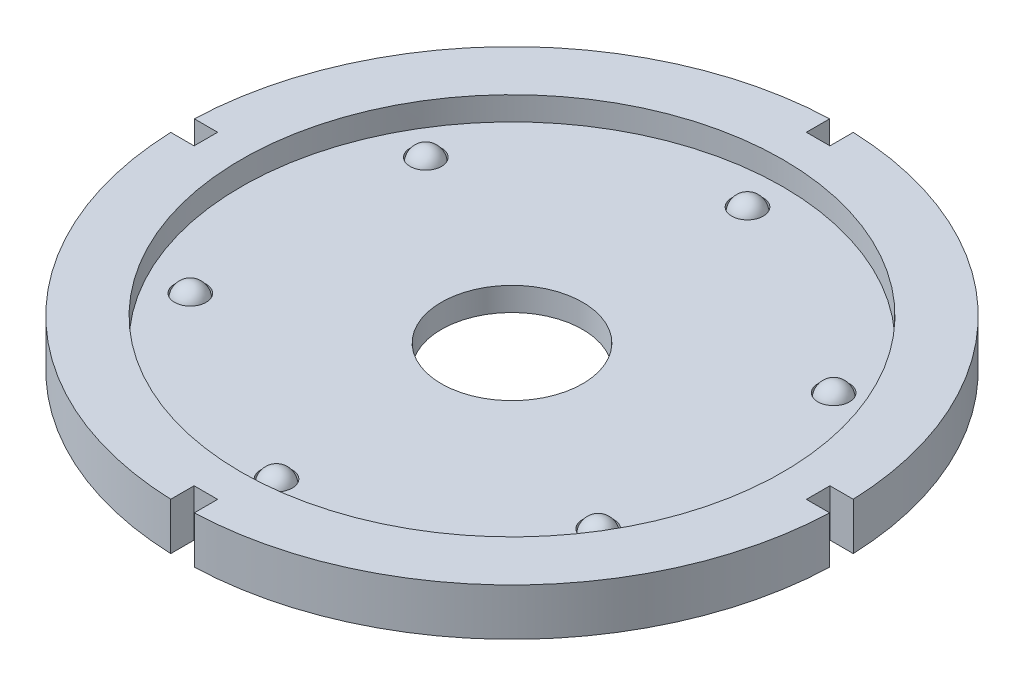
ISO-10303-21;
HEADER;
FILE_DESCRIPTION(('STEP AP214'),'2;1');
FILE_NAME('part.step','',(''),(''),'','','');
FILE_SCHEMA(('AUTOMOTIVE_DESIGN { 1 0 10303 214 1 1 1 1 }'));
ENDSEC;
DATA;
#1=APPLICATION_CONTEXT('core data for automotive mechanical design processes');
#2=APPLICATION_PROTOCOL_DEFINITION('international standard','automotive_design',2000,#1);
#3=PRODUCT_CONTEXT('',#1,'mechanical');
#4=PRODUCT('Part','Part','',(#3));
#5=PRODUCT_RELATED_PRODUCT_CATEGORY('part','',(#4));
#6=PRODUCT_DEFINITION_FORMATION('','',#4);
#7=PRODUCT_DEFINITION_CONTEXT('part definition',#1,'design');
#8=PRODUCT_DEFINITION('design','',#6,#7);
#9=PRODUCT_DEFINITION_SHAPE('','',#8);
#10=(LENGTH_UNIT() NAMED_UNIT(*) SI_UNIT(.MILLI.,.METRE.));
#11=(NAMED_UNIT(*) PLANE_ANGLE_UNIT() SI_UNIT($,.RADIAN.));
#12=(NAMED_UNIT(*) SI_UNIT($,.STERADIAN.) SOLID_ANGLE_UNIT());
#13=UNCERTAINTY_MEASURE_WITH_UNIT(LENGTH_MEASURE(1.E-05),#10,'distance_accuracy_value','');
#14=(GEOMETRIC_REPRESENTATION_CONTEXT(3) GLOBAL_UNCERTAINTY_ASSIGNED_CONTEXT((#13)) GLOBAL_UNIT_ASSIGNED_CONTEXT((#10,
#11,#12)) REPRESENTATION_CONTEXT('',''));
#15=CARTESIAN_POINT('',(0.,0.,0.));
#16=DIRECTION('',(0.,0.,1.));
#17=DIRECTION('',(1.,0.,0.));
#18=AXIS2_PLACEMENT_3D('',#15,#16,#17);
#19=CARTESIAN_POINT('',(43.308152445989,3.86417949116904,25.0039734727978));
#20=DIRECTION('',(0.,1.,0.));
#21=DIRECTION('',(-0.866025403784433,0.,-0.50000000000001));
#22=AXIS2_PLACEMENT_3D('',#19,#20,#21);
#23=SPHERICAL_SURFACE('',#22,3.25);
#24=CARTESIAN_POINT('',(43.308152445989,7.11417949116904,25.0039734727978));
#25=VERTEX_POINT('',#24);
#26=VERTEX_LOOP('',#25);
#27=FACE_BOUND('',#26,.T.);
#28=ADVANCED_FACE('F39',(#27),#23,.T.);
#29=CLOSED_SHELL('',(#28));
#30=MANIFOLD_SOLID_BREP('B2',#29);
#31=CARTESIAN_POINT('',(43.3081524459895,3.86417949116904,-25.0039734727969));
#32=DIRECTION('',(0.,1.,0.));
#33=DIRECTION('',(-0.866025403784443,0.,0.499999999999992));
#34=AXIS2_PLACEMENT_3D('',#31,#32,#33);
#35=SPHERICAL_SURFACE('',#34,3.25);
#36=CARTESIAN_POINT('',(43.3081524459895,7.11417949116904,-25.0039734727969));
#37=VERTEX_POINT('',#36);
#38=VERTEX_LOOP('',#37);
#39=FACE_BOUND('',#38,.T.);
#40=ADVANCED_FACE('F59',(#39),#35,.T.);
#41=CLOSED_SHELL('',(#40));
#42=MANIFOLD_SOLID_BREP('B6',#41);
#43=CARTESIAN_POINT('',(0.,3.86417949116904,-50.0079469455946));
#44=DIRECTION('',(0.,1.,0.));
#45=DIRECTION('',(0.,0.,1.));
#46=AXIS2_PLACEMENT_3D('',#43,#44,#45);
#47=SPHERICAL_SURFACE('',#46,3.25);
#48=CARTESIAN_POINT('',(0.,7.11417949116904,-50.0079469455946));
#49=VERTEX_POINT('',#48);
#50=VERTEX_LOOP('',#49);
#51=FACE_BOUND('',#50,.T.);
#52=ADVANCED_FACE('F79',(#51),#47,.T.);
#53=CLOSED_SHELL('',(#52));
#54=MANIFOLD_SOLID_BREP('B35',#53);
#55=CARTESIAN_POINT('',(-43.3081524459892,3.86417949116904,-25.0039734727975));
#56=DIRECTION('',(0.,1.,0.));
#57=DIRECTION('',(0.866025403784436,0.,0.500000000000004));
#58=AXIS2_PLACEMENT_3D('',#55,#56,#57);
#59=SPHERICAL_SURFACE('',#58,3.25);
#60=CARTESIAN_POINT('',(-43.3081524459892,7.11417949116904,-25.0039734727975));
#61=VERTEX_POINT('',#60);
#62=VERTEX_LOOP('',#61);
#63=FACE_BOUND('',#62,.T.);
#64=ADVANCED_FACE('F99',(#63),#59,.T.);
#65=CLOSED_SHELL('',(#64));
#66=MANIFOLD_SOLID_BREP('B55',#65);
#67=CARTESIAN_POINT('',(-43.3081524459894,3.86417949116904,25.0039734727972));
#68=DIRECTION('',(0.,1.,0.));
#69=DIRECTION('',(0.86602540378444,0.,-0.499999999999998));
#70=AXIS2_PLACEMENT_3D('',#67,#68,#69);
#71=SPHERICAL_SURFACE('',#70,3.25);
#72=CARTESIAN_POINT('',(-43.3081524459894,7.11417949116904,25.0039734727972));
#73=VERTEX_POINT('',#72);
#74=VERTEX_LOOP('',#73);
#75=FACE_BOUND('',#74,.T.);
#76=ADVANCED_FACE('F119',(#75),#71,.T.);
#77=CLOSED_SHELL('',(#76));
#78=MANIFOLD_SOLID_BREP('B75',#77);
#79=CARTESIAN_POINT('',(0.,3.86417949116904,50.0079469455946));
#80=DIRECTION('',(0.,1.,0.));
#81=DIRECTION('',(0.,0.,-1.));
#82=AXIS2_PLACEMENT_3D('',#79,#80,#81);
#83=SPHERICAL_SURFACE('',#82,3.25);
#84=CARTESIAN_POINT('',(0.,7.11417949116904,50.0079469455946));
#85=VERTEX_POINT('',#84);
#86=VERTEX_LOOP('',#85);
#87=FACE_BOUND('',#86,.T.);
#88=ADVANCED_FACE('F142',(#87),#83,.T.);
#89=CLOSED_SHELL('',(#88));
#90=MANIFOLD_SOLID_BREP('B95',#89);
#91=CARTESIAN_POINT('',(0.,10.,0.));
#92=DIRECTION('',(0.,1.,0.));
#93=DIRECTION('',(0.,0.,1.));
#94=AXIS2_PLACEMENT_3D('',#91,#92,#93);
#95=PLANE('',#94);
#96=DIRECTION('',(1.,0.,0.));
#97=VECTOR('',#96,1.);
#98=CARTESIAN_POINT('',(0.,10.,2.5));
#99=LINE('',#98,#97);
#100=CARTESIAN_POINT('',(65.,10.,2.5));
#101=VERTEX_POINT('',#100);
#102=CARTESIAN_POINT('',(69.9553428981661,10.,2.5));
#103=VERTEX_POINT('',#102);
#104=EDGE_CURVE('E348',#101,#103,#99,.T.);
#105=ORIENTED_EDGE('',*,*,#104,.F.);
#106=DIRECTION('',(0.,0.,1.));
#107=VECTOR('',#106,1.);
#108=CARTESIAN_POINT('',(65.,10.,0.));
#109=LINE('',#108,#107);
#110=CARTESIAN_POINT('',(65.,10.,-2.5));
#111=VERTEX_POINT('',#110);
#112=EDGE_CURVE('E358',#111,#101,#109,.T.);
#113=ORIENTED_EDGE('',*,*,#112,.F.);
#114=DIRECTION('',(1.,0.,0.));
#115=VECTOR('',#114,1.);
#116=CARTESIAN_POINT('',(0.,10.,-2.5));
#117=LINE('',#116,#115);
#118=CARTESIAN_POINT('',(69.9553428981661,10.,-2.5));
#119=VERTEX_POINT('',#118);
#120=EDGE_CURVE('E272',#111,#119,#117,.T.);
#121=ORIENTED_EDGE('',*,*,#120,.T.);
#122=CARTESIAN_POINT('',(0.,10.,0.));
#123=DIRECTION('',(0.,1.,0.));
#124=DIRECTION('',(0.,0.,1.));
#125=AXIS2_PLACEMENT_3D('',#122,#123,#124);
#126=CIRCLE('',#125,70.);
#127=CARTESIAN_POINT('',(2.5,10.,-69.9553428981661));
#128=VERTEX_POINT('',#127);
#129=EDGE_CURVE('E379',#119,#128,#126,.T.);
#130=ORIENTED_EDGE('',*,*,#129,.T.);
#131=DIRECTION('',(0.,0.,-1.));
#132=VECTOR('',#131,1.);
#133=CARTESIAN_POINT('',(2.50000000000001,10.,0.));
#134=LINE('',#133,#132);
#135=CARTESIAN_POINT('',(2.5,10.,-65.));
#136=VERTEX_POINT('',#135);
#137=EDGE_CURVE('E298',#136,#128,#134,.T.);
#138=ORIENTED_EDGE('',*,*,#137,.F.);
#139=DIRECTION('',(1.,0.,0.));
#140=VECTOR('',#139,1.);
#141=CARTESIAN_POINT('',(0.,10.,-65.));
#142=LINE('',#141,#140);
#143=CARTESIAN_POINT('',(-2.5,10.,-65.));
#144=VERTEX_POINT('',#143);
#145=EDGE_CURVE('E350',#144,#136,#142,.T.);
#146=ORIENTED_EDGE('',*,*,#145,.F.);
#147=DIRECTION('',(0.,0.,-1.));
#148=VECTOR('',#147,1.);
#149=CARTESIAN_POINT('',(-2.5,10.,0.));
#150=LINE('',#149,#148);
#151=CARTESIAN_POINT('',(-2.5,10.,-69.9553428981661));
#152=VERTEX_POINT('',#151);
#153=EDGE_CURVE('E335',#144,#152,#150,.T.);
#154=ORIENTED_EDGE('',*,*,#153,.T.);
#155=CARTESIAN_POINT('',(-69.9553428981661,10.,-2.5));
#156=VERTEX_POINT('',#155);
#157=EDGE_CURVE('E419',#152,#156,#126,.T.);
#158=ORIENTED_EDGE('',*,*,#157,.T.);
#159=DIRECTION('',(-1.,0.,0.));
#160=VECTOR('',#159,1.);
#161=CARTESIAN_POINT('',(0.,10.,-2.5));
#162=LINE('',#161,#160);
#163=CARTESIAN_POINT('',(-65.,10.,-2.5));
#164=VERTEX_POINT('',#163);
#165=EDGE_CURVE('E338',#164,#156,#162,.T.);
#166=ORIENTED_EDGE('',*,*,#165,.F.);
#167=DIRECTION('',(0.,0.,1.));
#168=VECTOR('',#167,1.);
#169=CARTESIAN_POINT('',(-65.,10.,0.));
#170=LINE('',#169,#168);
#171=CARTESIAN_POINT('',(-65.,10.,2.5));
#172=VERTEX_POINT('',#171);
#173=EDGE_CURVE('E352',#164,#172,#170,.T.);
#174=ORIENTED_EDGE('',*,*,#173,.T.);
#175=DIRECTION('',(-1.,0.,0.));
#176=VECTOR('',#175,1.);
#177=CARTESIAN_POINT('',(0.,10.,2.5));
#178=LINE('',#177,#176);
#179=CARTESIAN_POINT('',(-69.9553428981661,10.,2.5));
#180=VERTEX_POINT('',#179);
#181=EDGE_CURVE('E340',#172,#180,#178,.T.);
#182=ORIENTED_EDGE('',*,*,#181,.T.);
#183=CARTESIAN_POINT('',(-2.5,10.,69.9553428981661));
#184=VERTEX_POINT('',#183);
#185=EDGE_CURVE('E380',#180,#184,#126,.T.);
#186=ORIENTED_EDGE('',*,*,#185,.T.);
#187=DIRECTION('',(0.,0.,1.));
#188=VECTOR('',#187,1.);
#189=CARTESIAN_POINT('',(-2.5,10.,0.));
#190=LINE('',#189,#188);
#191=CARTESIAN_POINT('',(-2.5,10.,65.));
#192=VERTEX_POINT('',#191);
#193=EDGE_CURVE('E179',#192,#184,#190,.T.);
#194=ORIENTED_EDGE('',*,*,#193,.F.);
#195=DIRECTION('',(1.,0.,0.));
#196=VECTOR('',#195,1.);
#197=CARTESIAN_POINT('',(0.,10.,65.));
#198=LINE('',#197,#196);
#199=CARTESIAN_POINT('',(2.5,10.,65.));
#200=VERTEX_POINT('',#199);
#201=EDGE_CURVE('E355',#192,#200,#198,.T.);
#202=ORIENTED_EDGE('',*,*,#201,.T.);
#203=DIRECTION('',(0.,0.,1.));
#204=VECTOR('',#203,1.);
#205=CARTESIAN_POINT('',(2.50000000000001,10.,0.));
#206=LINE('',#205,#204);
#207=CARTESIAN_POINT('',(2.5,10.,69.9553428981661));
#208=VERTEX_POINT('',#207);
#209=EDGE_CURVE('E344',#200,#208,#206,.T.);
#210=ORIENTED_EDGE('',*,*,#209,.T.);
#211=EDGE_CURVE('E375',#208,#103,#126,.T.);
#212=ORIENTED_EDGE('',*,*,#211,.T.);
#213=EDGE_LOOP('',(#105,#113,#121,#130,#138,#146,#154,#158,#166,#174,#182,#186,#194,#202,#210,#212));
#214=FACE_BOUND('',#213,.T.);
#215=CARTESIAN_POINT('',(0.,10.,0.));
#216=DIRECTION('',(0.,1.,0.));
#217=DIRECTION('',(0.,0.,1.));
#218=AXIS2_PLACEMENT_3D('',#215,#216,#217);
#219=CIRCLE('',#218,57.5);
#220=CARTESIAN_POINT('',(0.,10.,57.5));
#221=VERTEX_POINT('',#220);
#222=EDGE_CURVE('E371',#221,#221,#219,.T.);
#223=ORIENTED_EDGE('',*,*,#222,.F.);
#224=EDGE_LOOP('',(#223));
#225=FACE_BOUND('',#224,.T.);
#226=ADVANCED_FACE('F156',(#214,#225),#95,.T.);
#227=CARTESIAN_POINT('',(0.,0.,0.));
#228=DIRECTION('',(0.,1.,0.));
#229=DIRECTION('',(0.,0.,1.));
#230=AXIS2_PLACEMENT_3D('',#227,#228,#229);
#231=PLANE('',#230);
#232=CARTESIAN_POINT('',(0.,0.,0.));
#233=DIRECTION('',(0.,1.,0.));
#234=DIRECTION('',(0.,0.,1.));
#235=AXIS2_PLACEMENT_3D('',#232,#233,#234);
#236=CIRCLE('',#235,15.);
#237=CARTESIAN_POINT('',(0.,0.,15.));
#238=VERTEX_POINT('',#237);
#239=EDGE_CURVE('E364',#238,#238,#236,.F.);
#240=ORIENTED_EDGE('',*,*,#239,.F.);
#241=EDGE_LOOP('',(#240));
#242=FACE_BOUND('',#241,.T.);
#243=DIRECTION('',(0.,0.,1.));
#244=VECTOR('',#243,1.);
#245=CARTESIAN_POINT('',(65.,0.,0.));
#246=LINE('',#245,#244);
#247=CARTESIAN_POINT('',(65.,0.,-2.5));
#248=VERTEX_POINT('',#247);
#249=CARTESIAN_POINT('',(65.,0.,2.5));
#250=VERTEX_POINT('',#249);
#251=EDGE_CURVE('E279',#248,#250,#246,.T.);
#252=ORIENTED_EDGE('',*,*,#251,.T.);
#253=DIRECTION('',(1.,0.,0.));
#254=VECTOR('',#253,1.);
#255=CARTESIAN_POINT('',(0.,0.,2.5));
#256=LINE('',#255,#254);
#257=CARTESIAN_POINT('',(69.9553428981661,0.,2.5));
#258=VERTEX_POINT('',#257);
#259=EDGE_CURVE('E276',#250,#258,#256,.T.);
#260=ORIENTED_EDGE('',*,*,#259,.T.);
#261=CARTESIAN_POINT('',(0.,0.,0.));
#262=DIRECTION('',(0.,1.,0.));
#263=DIRECTION('',(0.,0.,1.));
#264=AXIS2_PLACEMENT_3D('',#261,#262,#263);
#265=CIRCLE('',#264,70.);
#266=CARTESIAN_POINT('',(2.5,0.,69.9553428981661));
#267=VERTEX_POINT('',#266);
#268=EDGE_CURVE('E381',#267,#258,#265,.T.);
#269=ORIENTED_EDGE('',*,*,#268,.F.);
#270=DIRECTION('',(0.,0.,1.));
#271=VECTOR('',#270,1.);
#272=CARTESIAN_POINT('',(2.50000000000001,0.,0.));
#273=LINE('',#272,#271);
#274=CARTESIAN_POINT('',(2.5,0.,65.));
#275=VERTEX_POINT('',#274);
#276=EDGE_CURVE('E306',#275,#267,#273,.T.);
#277=ORIENTED_EDGE('',*,*,#276,.F.);
#278=DIRECTION('',(1.,0.,0.));
#279=VECTOR('',#278,1.);
#280=CARTESIAN_POINT('',(0.,0.,65.));
#281=LINE('',#280,#279);
#282=CARTESIAN_POINT('',(-2.5,0.,65.));
#283=VERTEX_POINT('',#282);
#284=EDGE_CURVE('E300',#283,#275,#281,.T.);
#285=ORIENTED_EDGE('',*,*,#284,.F.);
#286=DIRECTION('',(0.,0.,1.));
#287=VECTOR('',#286,1.);
#288=CARTESIAN_POINT('',(-2.5,0.,0.));
#289=LINE('',#288,#287);
#290=CARTESIAN_POINT('',(-2.5,0.,69.9553428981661));
#291=VERTEX_POINT('',#290);
#292=EDGE_CURVE('E302',#283,#291,#289,.T.);
#293=ORIENTED_EDGE('',*,*,#292,.T.);
#294=CARTESIAN_POINT('',(-69.9553428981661,0.,2.5));
#295=VERTEX_POINT('',#294);
#296=EDGE_CURVE('E374',#295,#291,#265,.T.);
#297=ORIENTED_EDGE('',*,*,#296,.F.);
#298=DIRECTION('',(-1.,0.,0.));
#299=VECTOR('',#298,1.);
#300=CARTESIAN_POINT('',(0.,0.,2.5));
#301=LINE('',#300,#299);
#302=CARTESIAN_POINT('',(-65.,0.,2.5));
#303=VERTEX_POINT('',#302);
#304=EDGE_CURVE('E309',#303,#295,#301,.T.);
#305=ORIENTED_EDGE('',*,*,#304,.F.);
#306=DIRECTION('',(0.,0.,1.));
#307=VECTOR('',#306,1.);
#308=CARTESIAN_POINT('',(-65.,0.,0.));
#309=LINE('',#308,#307);
#310=CARTESIAN_POINT('',(-65.,0.,-2.5));
#311=VERTEX_POINT('',#310);
#312=EDGE_CURVE('E311',#311,#303,#309,.T.);
#313=ORIENTED_EDGE('',*,*,#312,.F.);
#314=DIRECTION('',(-1.,0.,0.));
#315=VECTOR('',#314,1.);
#316=CARTESIAN_POINT('',(0.,0.,-2.5));
#317=LINE('',#316,#315);
#318=CARTESIAN_POINT('',(-69.9553428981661,0.,-2.5));
#319=VERTEX_POINT('',#318);
#320=EDGE_CURVE('E314',#311,#319,#317,.T.);
#321=ORIENTED_EDGE('',*,*,#320,.T.);
#322=CARTESIAN_POINT('',(-2.5,0.,-69.9553428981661));
#323=VERTEX_POINT('',#322);
#324=EDGE_CURVE('E757',#323,#319,#265,.T.);
#325=ORIENTED_EDGE('',*,*,#324,.F.);
#326=DIRECTION('',(0.,0.,-1.));
#327=VECTOR('',#326,1.);
#328=CARTESIAN_POINT('',(-2.5,0.,0.));
#329=LINE('',#328,#327);
#330=CARTESIAN_POINT('',(-2.5,0.,-65.));
#331=VERTEX_POINT('',#330);
#332=EDGE_CURVE('E322',#331,#323,#329,.T.);
#333=ORIENTED_EDGE('',*,*,#332,.F.);
#334=DIRECTION('',(1.,0.,0.));
#335=VECTOR('',#334,1.);
#336=CARTESIAN_POINT('',(0.,0.,-65.));
#337=LINE('',#336,#335);
#338=CARTESIAN_POINT('',(2.5,0.,-65.));
#339=VERTEX_POINT('',#338);
#340=EDGE_CURVE('E324',#331,#339,#337,.T.);
#341=ORIENTED_EDGE('',*,*,#340,.T.);
#342=DIRECTION('',(0.,0.,-1.));
#343=VECTOR('',#342,1.);
#344=CARTESIAN_POINT('',(2.50000000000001,0.,0.));
#345=LINE('',#344,#343);
#346=CARTESIAN_POINT('',(2.5,0.,-69.9553428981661));
#347=VERTEX_POINT('',#346);
#348=EDGE_CURVE('E327',#339,#347,#345,.T.);
#349=ORIENTED_EDGE('',*,*,#348,.T.);
#350=CARTESIAN_POINT('',(69.9553428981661,0.,-2.5));
#351=VERTEX_POINT('',#350);
#352=EDGE_CURVE('E290',#351,#347,#265,.T.);
#353=ORIENTED_EDGE('',*,*,#352,.F.);
#354=DIRECTION('',(1.,0.,0.));
#355=VECTOR('',#354,1.);
#356=CARTESIAN_POINT('',(0.,0.,-2.5));
#357=LINE('',#356,#355);
#358=EDGE_CURVE('E171',#248,#351,#357,.T.);
#359=ORIENTED_EDGE('',*,*,#358,.F.);
#360=EDGE_LOOP('',(#252,#260,#269,#277,#285,#293,#297,#305,#313,#321,#325,#333,#341,#349,#353,#359));
#361=FACE_BOUND('',#360,.T.);
#362=ADVANCED_FACE('F287',(#242,#361),#231,.F.);
#363=CARTESIAN_POINT('',(0.,10.,0.));
#364=DIRECTION('',(0.,-1.,0.));
#365=DIRECTION('',(0.,0.,-1.));
#366=AXIS2_PLACEMENT_3D('',#363,#364,#365);
#367=CYLINDRICAL_SURFACE('',#366,70.);
#368=DIRECTION('',(0.,-1.,0.));
#369=VECTOR('',#368,1.);
#370=CARTESIAN_POINT('',(69.9553428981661,10.,-2.5));
#371=LINE('',#370,#369);
#372=EDGE_CURVE('E164',#351,#119,#371,.F.);
#373=ORIENTED_EDGE('',*,*,#372,.F.);
#374=ORIENTED_EDGE('',*,*,#352,.T.);
#375=DIRECTION('',(0.,-1.,0.));
#376=VECTOR('',#375,1.);
#377=CARTESIAN_POINT('',(2.5,10.,-69.9553428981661));
#378=LINE('',#377,#376);
#379=EDGE_CURVE('E378',#347,#128,#378,.F.);
#380=ORIENTED_EDGE('',*,*,#379,.T.);
#381=ORIENTED_EDGE('',*,*,#129,.F.);
#382=EDGE_LOOP('',(#373,#374,#380,#381));
#383=FACE_BOUND('',#382,.T.);
#384=ADVANCED_FACE('F158',(#383),#367,.T.);
#385=ORIENTED_EDGE('',*,*,#268,.T.);
#386=DIRECTION('',(0.,-1.,0.));
#387=VECTOR('',#386,1.);
#388=CARTESIAN_POINT('',(69.9553428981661,10.,2.5));
#389=LINE('',#388,#387);
#390=EDGE_CURVE('E140',#258,#103,#389,.F.);
#391=ORIENTED_EDGE('',*,*,#390,.T.);
#392=ORIENTED_EDGE('',*,*,#211,.F.);
#393=DIRECTION('',(0.,-1.,0.));
#394=VECTOR('',#393,1.);
#395=CARTESIAN_POINT('',(2.5,10.,69.9553428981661));
#396=LINE('',#395,#394);
#397=EDGE_CURVE('E411',#267,#208,#396,.F.);
#398=ORIENTED_EDGE('',*,*,#397,.F.);
#399=EDGE_LOOP('',(#385,#391,#392,#398));
#400=FACE_BOUND('',#399,.T.);
#401=ADVANCED_FACE('F444',(#400),#367,.T.);
#402=ORIENTED_EDGE('',*,*,#296,.T.);
#403=DIRECTION('',(0.,-1.,0.));
#404=VECTOR('',#403,1.);
#405=CARTESIAN_POINT('',(-2.5,10.,69.9553428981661));
#406=LINE('',#405,#404);
#407=EDGE_CURVE('E409',#291,#184,#406,.F.);
#408=ORIENTED_EDGE('',*,*,#407,.T.);
#409=ORIENTED_EDGE('',*,*,#185,.F.);
#410=DIRECTION('',(0.,-1.,0.));
#411=VECTOR('',#410,1.);
#412=CARTESIAN_POINT('',(-69.9553428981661,10.,2.5));
#413=LINE('',#412,#411);
#414=EDGE_CURVE('E407',#295,#180,#413,.F.);
#415=ORIENTED_EDGE('',*,*,#414,.F.);
#416=EDGE_LOOP('',(#402,#408,#409,#415));
#417=FACE_BOUND('',#416,.T.);
#418=ADVANCED_FACE('F428',(#417),#367,.T.);
#419=ORIENTED_EDGE('',*,*,#324,.T.);
#420=DIRECTION('',(0.,-1.,0.));
#421=VECTOR('',#420,1.);
#422=CARTESIAN_POINT('',(-69.9553428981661,10.,-2.5));
#423=LINE('',#422,#421);
#424=EDGE_CURVE('E404',#319,#156,#423,.F.);
#425=ORIENTED_EDGE('',*,*,#424,.T.);
#426=ORIENTED_EDGE('',*,*,#157,.F.);
#427=DIRECTION('',(0.,-1.,0.));
#428=VECTOR('',#427,1.);
#429=CARTESIAN_POINT('',(-2.5,10.,-69.9553428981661));
#430=LINE('',#429,#428);
#431=EDGE_CURVE('E402',#323,#152,#430,.F.);
#432=ORIENTED_EDGE('',*,*,#431,.F.);
#433=EDGE_LOOP('',(#419,#425,#426,#432));
#434=FACE_BOUND('',#433,.T.);
#435=ADVANCED_FACE('F466',(#434),#367,.T.);
#436=CARTESIAN_POINT('',(0.,10.,0.));
#437=DIRECTION('',(0.,-1.,0.));
#438=DIRECTION('',(0.,0.,-1.));
#439=AXIS2_PLACEMENT_3D('',#436,#437,#438);
#440=CYLINDRICAL_SURFACE('',#439,57.5);
#441=ORIENTED_EDGE('',*,*,#222,.T.);
#442=EDGE_LOOP('',(#441));
#443=FACE_BOUND('',#442,.T.);
#444=CARTESIAN_POINT('',(0.,5.,0.));
#445=DIRECTION('',(0.,-1.,0.));
#446=DIRECTION('',(0.,0.,-1.));
#447=AXIS2_PLACEMENT_3D('',#444,#445,#446);
#448=CIRCLE('',#447,57.5);
#449=CARTESIAN_POINT('',(0.,5.,-57.5));
#450=VERTEX_POINT('',#449);
#451=EDGE_CURVE('E368',#450,#450,#448,.T.);
#452=ORIENTED_EDGE('',*,*,#451,.T.);
#453=EDGE_LOOP('',(#452));
#454=FACE_BOUND('',#453,.T.);
#455=ADVANCED_FACE('F462',(#443,#454),#440,.F.);
#456=CARTESIAN_POINT('',(0.,5.,0.));
#457=DIRECTION('',(0.,-1.,0.));
#458=DIRECTION('',(0.,0.,-1.));
#459=AXIS2_PLACEMENT_3D('',#456,#457,#458);
#460=PLANE('',#459);
#461=CARTESIAN_POINT('',(-43.3012701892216,5.,25.0000000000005));
#462=DIRECTION('',(0.,-1.,0.));
#463=DIRECTION('',(0.,0.,-1.));
#464=AXIS2_PLACEMENT_3D('',#461,#462,#463);
#465=CIRCLE('',#464,3.35410196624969);
#466=CARTESIAN_POINT('',(-43.3012701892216,5.,21.6458980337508));
#467=VERTEX_POINT('',#466);
#468=EDGE_CURVE('E360',#467,#467,#465,.T.);
#469=ORIENTED_EDGE('',*,*,#468,.T.);
#470=EDGE_LOOP('',(#469));
#471=FACE_BOUND('',#470,.T.);
#472=CARTESIAN_POINT('',(-43.3012701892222,5.,-24.9999999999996));
#473=DIRECTION('',(0.,-1.,0.));
#474=DIRECTION('',(0.,0.,-1.));
#475=AXIS2_PLACEMENT_3D('',#472,#473,#474);
#476=CIRCLE('',#475,3.35410196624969);
#477=CARTESIAN_POINT('',(-43.3012701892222,5.,-28.3541019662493));
#478=VERTEX_POINT('',#477);
#479=EDGE_CURVE('E395',#478,#478,#476,.T.);
#480=ORIENTED_EDGE('',*,*,#479,.T.);
#481=EDGE_LOOP('',(#480));
#482=FACE_BOUND('',#481,.T.);
#483=CARTESIAN_POINT('',(0.,5.,-50.));
#484=DIRECTION('',(0.,-1.,0.));
#485=DIRECTION('',(0.,0.,-1.));
#486=AXIS2_PLACEMENT_3D('',#483,#484,#485);
#487=CIRCLE('',#486,3.35410196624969);
#488=CARTESIAN_POINT('',(0.,5.,-53.3541019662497));
#489=VERTEX_POINT('',#488);
#490=EDGE_CURVE('E392',#489,#489,#487,.T.);
#491=ORIENTED_EDGE('',*,*,#490,.T.);
#492=EDGE_LOOP('',(#491));
#493=FACE_BOUND('',#492,.T.);
#494=CARTESIAN_POINT('',(43.3012701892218,5.,-25.0000000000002));
#495=DIRECTION('',(0.,-1.,0.));
#496=DIRECTION('',(0.,0.,-1.));
#497=AXIS2_PLACEMENT_3D('',#494,#495,#496);
#498=CIRCLE('',#497,3.35410196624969);
#499=CARTESIAN_POINT('',(43.3012701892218,5.,-28.3541019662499));
#500=VERTEX_POINT('',#499);
#501=EDGE_CURVE('E389',#500,#500,#498,.T.);
#502=ORIENTED_EDGE('',*,*,#501,.T.);
#503=EDGE_LOOP('',(#502));
#504=FACE_BOUND('',#503,.T.);
#505=CARTESIAN_POINT('',(43.301270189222,5.,24.9999999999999));
#506=DIRECTION('',(0.,-1.,0.));
#507=DIRECTION('',(0.,0.,-1.));
#508=AXIS2_PLACEMENT_3D('',#505,#506,#507);
#509=CIRCLE('',#508,3.35410196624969);
#510=CARTESIAN_POINT('',(43.301270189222,5.,21.6458980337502));
#511=VERTEX_POINT('',#510);
#512=EDGE_CURVE('E386',#511,#511,#509,.T.);
#513=ORIENTED_EDGE('',*,*,#512,.T.);
#514=EDGE_LOOP('',(#513));
#515=FACE_BOUND('',#514,.T.);
#516=CARTESIAN_POINT('',(0.,5.,50.));
#517=DIRECTION('',(0.,-1.,0.));
#518=DIRECTION('',(0.,0.,-1.));
#519=AXIS2_PLACEMENT_3D('',#516,#517,#518);
#520=CIRCLE('',#519,3.35410196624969);
#521=CARTESIAN_POINT('',(0.,5.,46.6458980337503));
#522=VERTEX_POINT('',#521);
#523=EDGE_CURVE('E365',#522,#522,#520,.T.);
#524=ORIENTED_EDGE('',*,*,#523,.T.);
#525=EDGE_LOOP('',(#524));
#526=FACE_BOUND('',#525,.T.);
#527=CARTESIAN_POINT('',(0.,5.,0.));
#528=DIRECTION('',(0.,1.,0.));
#529=DIRECTION('',(0.,0.,1.));
#530=AXIS2_PLACEMENT_3D('',#527,#528,#529);
#531=CIRCLE('',#530,15.);
#532=CARTESIAN_POINT('',(0.,5.,15.));
#533=VERTEX_POINT('',#532);
#534=EDGE_CURVE('E361',#533,#533,#531,.T.);
#535=ORIENTED_EDGE('',*,*,#534,.F.);
#536=EDGE_LOOP('',(#535));
#537=FACE_BOUND('',#536,.T.);
#538=ORIENTED_EDGE('',*,*,#451,.F.);
#539=EDGE_LOOP('',(#538));
#540=FACE_BOUND('',#539,.T.);
#541=ADVANCED_FACE('F465',(#471,#482,#493,#504,#515,#526,#537,#540),#460,.F.);
#542=CARTESIAN_POINT('',(0.,-0.00100000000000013,0.));
#543=DIRECTION('',(0.,1.,0.));
#544=DIRECTION('',(0.,0.,1.));
#545=AXIS2_PLACEMENT_3D('',#542,#543,#544);
#546=CYLINDRICAL_SURFACE('',#545,15.);
#547=ORIENTED_EDGE('',*,*,#534,.T.);
#548=EDGE_LOOP('',(#547));
#549=FACE_BOUND('',#548,.T.);
#550=ORIENTED_EDGE('',*,*,#239,.T.);
#551=EDGE_LOOP('',(#550));
#552=FACE_BOUND('',#551,.T.);
#553=ADVANCED_FACE('F470',(#549,#552),#546,.F.);
#554=CARTESIAN_POINT('',(0.,4.,50.));
#555=DIRECTION('',(0.,1.,0.));
#556=DIRECTION('',(0.,0.,1.));
#557=AXIS2_PLACEMENT_3D('',#554,#555,#556);
#558=SPHERICAL_SURFACE('',#557,3.5);
#559=ORIENTED_EDGE('',*,*,#523,.F.);
#560=EDGE_LOOP('',(#559));
#561=FACE_BOUND('',#560,.T.);
#562=ADVANCED_FACE('F474',(#561),#558,.F.);
#563=CARTESIAN_POINT('',(43.301270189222,4.,24.9999999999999));
#564=DIRECTION('',(0.,1.,0.));
#565=DIRECTION('',(0.86602540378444,0.,0.499999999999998));
#566=AXIS2_PLACEMENT_3D('',#563,#564,#565);
#567=SPHERICAL_SURFACE('',#566,3.5);
#568=ORIENTED_EDGE('',*,*,#512,.F.);
#569=EDGE_LOOP('',(#568));
#570=FACE_BOUND('',#569,.T.);
#571=ADVANCED_FACE('F478',(#570),#567,.F.);
#572=CARTESIAN_POINT('',(43.3012701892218,4.,-25.0000000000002));
#573=DIRECTION('',(0.,1.,0.));
#574=DIRECTION('',(0.866025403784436,0.,-0.500000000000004));
#575=AXIS2_PLACEMENT_3D('',#572,#573,#574);
#576=SPHERICAL_SURFACE('',#575,3.5);
#577=ORIENTED_EDGE('',*,*,#501,.F.);
#578=EDGE_LOOP('',(#577));
#579=FACE_BOUND('',#578,.T.);
#580=ADVANCED_FACE('F482',(#579),#576,.F.);
#581=CARTESIAN_POINT('',(0.,4.,-50.));
#582=DIRECTION('',(0.,1.,0.));
#583=DIRECTION('',(0.,0.,-1.));
#584=AXIS2_PLACEMENT_3D('',#581,#582,#583);
#585=SPHERICAL_SURFACE('',#584,3.5);
#586=ORIENTED_EDGE('',*,*,#490,.F.);
#587=EDGE_LOOP('',(#586));
#588=FACE_BOUND('',#587,.T.);
#589=ADVANCED_FACE('F486',(#588),#585,.F.);
#590=CARTESIAN_POINT('',(-43.3012701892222,4.,-24.9999999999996));
#591=DIRECTION('',(0.,1.,0.));
#592=DIRECTION('',(-0.866025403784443,0.,-0.499999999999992));
#593=AXIS2_PLACEMENT_3D('',#590,#591,#592);
#594=SPHERICAL_SURFACE('',#593,3.5);
#595=ORIENTED_EDGE('',*,*,#479,.F.);
#596=EDGE_LOOP('',(#595));
#597=FACE_BOUND('',#596,.T.);
#598=ADVANCED_FACE('F490',(#597),#594,.F.);
#599=CARTESIAN_POINT('',(-43.3012701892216,4.,25.0000000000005));
#600=DIRECTION('',(0.,1.,0.));
#601=DIRECTION('',(-0.866025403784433,0.,0.50000000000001));
#602=AXIS2_PLACEMENT_3D('',#599,#600,#601);
#603=SPHERICAL_SURFACE('',#602,3.5);
#604=ORIENTED_EDGE('',*,*,#468,.F.);
#605=EDGE_LOOP('',(#604));
#606=FACE_BOUND('',#605,.T.);
#607=ADVANCED_FACE('F494',(#606),#603,.F.);
#608=CARTESIAN_POINT('',(-2.5,0.,0.));
#609=DIRECTION('',(1.,0.,0.));
#610=DIRECTION('',(0.,0.,-1.));
#611=AXIS2_PLACEMENT_3D('',#608,#609,#610);
#612=PLANE('',#611);
#613=DIRECTION('',(0.,1.,0.));
#614=VECTOR('',#613,1.);
#615=CARTESIAN_POINT('',(-2.5,0.,-65.));
#616=LINE('',#615,#614);
#617=EDGE_CURVE('E329',#331,#144,#616,.T.);
#618=ORIENTED_EDGE('',*,*,#617,.F.);
#619=ORIENTED_EDGE('',*,*,#332,.T.);
#620=ORIENTED_EDGE('',*,*,#431,.T.);
#621=ORIENTED_EDGE('',*,*,#153,.F.);
#622=EDGE_LOOP('',(#618,#619,#620,#621));
#623=FACE_BOUND('',#622,.T.);
#624=ADVANCED_FACE('F498',(#623),#612,.T.);
#625=CARTESIAN_POINT('',(2.50000000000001,0.,0.));
#626=DIRECTION('',(1.,0.,0.));
#627=DIRECTION('',(0.,0.,-1.));
#628=AXIS2_PLACEMENT_3D('',#625,#626,#627);
#629=PLANE('',#628);
#630=ORIENTED_EDGE('',*,*,#137,.T.);
#631=ORIENTED_EDGE('',*,*,#379,.F.);
#632=ORIENTED_EDGE('',*,*,#348,.F.);
#633=DIRECTION('',(0.,1.,0.));
#634=VECTOR('',#633,1.);
#635=CARTESIAN_POINT('',(2.5,0.,-65.));
#636=LINE('',#635,#634);
#637=EDGE_CURVE('E312',#339,#136,#636,.T.);
#638=ORIENTED_EDGE('',*,*,#637,.T.);
#639=EDGE_LOOP('',(#630,#631,#632,#638));
#640=FACE_BOUND('',#639,.T.);
#641=ADVANCED_FACE('F502',(#640),#629,.F.);
#642=CARTESIAN_POINT('',(0.,0.,-65.));
#643=DIRECTION('',(0.,0.,1.));
#644=DIRECTION('',(1.,0.,0.));
#645=AXIS2_PLACEMENT_3D('',#642,#643,#644);
#646=PLANE('',#645);
#647=ORIENTED_EDGE('',*,*,#145,.T.);
#648=ORIENTED_EDGE('',*,*,#637,.F.);
#649=ORIENTED_EDGE('',*,*,#340,.F.);
#650=ORIENTED_EDGE('',*,*,#617,.T.);
#651=EDGE_LOOP('',(#647,#648,#649,#650));
#652=FACE_BOUND('',#651,.T.);
#653=ADVANCED_FACE('F504',(#652),#646,.F.);
#654=CARTESIAN_POINT('',(0.,0.,2.5));
#655=DIRECTION('',(0.,0.,-1.));
#656=DIRECTION('',(-1.,0.,0.));
#657=AXIS2_PLACEMENT_3D('',#654,#655,#656);
#658=PLANE('',#657);
#659=DIRECTION('',(0.,1.,0.));
#660=VECTOR('',#659,1.);
#661=CARTESIAN_POINT('',(-65.,0.,2.5));
#662=LINE('',#661,#660);
#663=EDGE_CURVE('E317',#303,#172,#662,.T.);
#664=ORIENTED_EDGE('',*,*,#663,.F.);
#665=ORIENTED_EDGE('',*,*,#304,.T.);
#666=ORIENTED_EDGE('',*,*,#414,.T.);
#667=ORIENTED_EDGE('',*,*,#181,.F.);
#668=EDGE_LOOP('',(#664,#665,#666,#667));
#669=FACE_BOUND('',#668,.T.);
#670=ADVANCED_FACE('F507',(#669),#658,.T.);
#671=CARTESIAN_POINT('',(0.,0.,-2.5));
#672=DIRECTION('',(0.,0.,-1.));
#673=DIRECTION('',(-1.,0.,0.));
#674=AXIS2_PLACEMENT_3D('',#671,#672,#673);
#675=PLANE('',#674);
#676=ORIENTED_EDGE('',*,*,#165,.T.);
#677=ORIENTED_EDGE('',*,*,#424,.F.);
#678=ORIENTED_EDGE('',*,*,#320,.F.);
#679=DIRECTION('',(0.,1.,0.));
#680=VECTOR('',#679,1.);
#681=CARTESIAN_POINT('',(-65.,0.,-2.5));
#682=LINE('',#681,#680);
#683=EDGE_CURVE('E303',#311,#164,#682,.T.);
#684=ORIENTED_EDGE('',*,*,#683,.T.);
#685=EDGE_LOOP('',(#676,#677,#678,#684));
#686=FACE_BOUND('',#685,.T.);
#687=ADVANCED_FACE('F514',(#686),#675,.F.);
#688=CARTESIAN_POINT('',(-65.,0.,0.));
#689=DIRECTION('',(-1.,0.,0.));
#690=DIRECTION('',(0.,0.,1.));
#691=AXIS2_PLACEMENT_3D('',#688,#689,#690);
#692=PLANE('',#691);
#693=ORIENTED_EDGE('',*,*,#683,.F.);
#694=ORIENTED_EDGE('',*,*,#312,.T.);
#695=ORIENTED_EDGE('',*,*,#663,.T.);
#696=ORIENTED_EDGE('',*,*,#173,.F.);
#697=EDGE_LOOP('',(#693,#694,#695,#696));
#698=FACE_BOUND('',#697,.T.);
#699=ADVANCED_FACE('F516',(#698),#692,.T.);
#700=CARTESIAN_POINT('',(0.,0.,65.));
#701=DIRECTION('',(0.,0.,1.));
#702=DIRECTION('',(1.,0.,0.));
#703=AXIS2_PLACEMENT_3D('',#700,#701,#702);
#704=PLANE('',#703);
#705=DIRECTION('',(0.,1.,0.));
#706=VECTOR('',#705,1.);
#707=CARTESIAN_POINT('',(-2.5,0.,65.));
#708=LINE('',#707,#706);
#709=EDGE_CURVE('E294',#283,#192,#708,.T.);
#710=ORIENTED_EDGE('',*,*,#709,.F.);
#711=ORIENTED_EDGE('',*,*,#284,.T.);
#712=DIRECTION('',(0.,1.,0.));
#713=VECTOR('',#712,1.);
#714=CARTESIAN_POINT('',(2.5,0.,65.));
#715=LINE('',#714,#713);
#716=EDGE_CURVE('E291',#275,#200,#715,.T.);
#717=ORIENTED_EDGE('',*,*,#716,.T.);
#718=ORIENTED_EDGE('',*,*,#201,.F.);
#719=EDGE_LOOP('',(#710,#711,#717,#718));
#720=FACE_BOUND('',#719,.T.);
#721=ADVANCED_FACE('F438',(#720),#704,.T.);
#722=CARTESIAN_POINT('',(2.50000000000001,0.,0.));
#723=DIRECTION('',(-1.,0.,0.));
#724=DIRECTION('',(0.,0.,1.));
#725=AXIS2_PLACEMENT_3D('',#722,#723,#724);
#726=PLANE('',#725);
#727=ORIENTED_EDGE('',*,*,#716,.F.);
#728=ORIENTED_EDGE('',*,*,#276,.T.);
#729=ORIENTED_EDGE('',*,*,#397,.T.);
#730=ORIENTED_EDGE('',*,*,#209,.F.);
#731=EDGE_LOOP('',(#727,#728,#729,#730));
#732=FACE_BOUND('',#731,.T.);
#733=ADVANCED_FACE('F440',(#732),#726,.T.);
#734=CARTESIAN_POINT('',(-2.5,0.,0.));
#735=DIRECTION('',(-1.,0.,0.));
#736=DIRECTION('',(0.,0.,1.));
#737=AXIS2_PLACEMENT_3D('',#734,#735,#736);
#738=PLANE('',#737);
#739=ORIENTED_EDGE('',*,*,#193,.T.);
#740=ORIENTED_EDGE('',*,*,#407,.F.);
#741=ORIENTED_EDGE('',*,*,#292,.F.);
#742=ORIENTED_EDGE('',*,*,#709,.T.);
#743=EDGE_LOOP('',(#739,#740,#741,#742));
#744=FACE_BOUND('',#743,.T.);
#745=ADVANCED_FACE('F431',(#744),#738,.F.);
#746=CARTESIAN_POINT('',(0.,0.,2.5));
#747=DIRECTION('',(0.,0.,1.));
#748=DIRECTION('',(1.,0.,0.));
#749=AXIS2_PLACEMENT_3D('',#746,#747,#748);
#750=PLANE('',#749);
#751=ORIENTED_EDGE('',*,*,#104,.T.);
#752=ORIENTED_EDGE('',*,*,#390,.F.);
#753=ORIENTED_EDGE('',*,*,#259,.F.);
#754=DIRECTION('',(0.,1.,0.));
#755=VECTOR('',#754,1.);
#756=CARTESIAN_POINT('',(65.,0.,2.5));
#757=LINE('',#756,#755);
#758=EDGE_CURVE('E275',#250,#101,#757,.T.);
#759=ORIENTED_EDGE('',*,*,#758,.T.);
#760=EDGE_LOOP('',(#751,#752,#753,#759));
#761=FACE_BOUND('',#760,.T.);
#762=ADVANCED_FACE('F446',(#761),#750,.F.);
#763=CARTESIAN_POINT('',(65.,0.,0.));
#764=DIRECTION('',(-1.,0.,0.));
#765=DIRECTION('',(0.,0.,1.));
#766=AXIS2_PLACEMENT_3D('',#763,#764,#765);
#767=PLANE('',#766);
#768=ORIENTED_EDGE('',*,*,#112,.T.);
#769=ORIENTED_EDGE('',*,*,#758,.F.);
#770=ORIENTED_EDGE('',*,*,#251,.F.);
#771=DIRECTION('',(0.,1.,0.));
#772=VECTOR('',#771,1.);
#773=CARTESIAN_POINT('',(65.,0.,-2.5));
#774=LINE('',#773,#772);
#775=EDGE_CURVE('E268',#248,#111,#774,.T.);
#776=ORIENTED_EDGE('',*,*,#775,.T.);
#777=EDGE_LOOP('',(#768,#769,#770,#776));
#778=FACE_BOUND('',#777,.T.);
#779=ADVANCED_FACE('F280',(#778),#767,.F.);
#780=CARTESIAN_POINT('',(0.,0.,-2.5));
#781=DIRECTION('',(0.,0.,1.));
#782=DIRECTION('',(1.,0.,0.));
#783=AXIS2_PLACEMENT_3D('',#780,#781,#782);
#784=PLANE('',#783);
#785=ORIENTED_EDGE('',*,*,#775,.F.);
#786=ORIENTED_EDGE('',*,*,#358,.T.);
#787=ORIENTED_EDGE('',*,*,#372,.T.);
#788=ORIENTED_EDGE('',*,*,#120,.F.);
#789=EDGE_LOOP('',(#785,#786,#787,#788));
#790=FACE_BOUND('',#789,.T.);
#791=ADVANCED_FACE('F270',(#790),#784,.T.);
#792=CLOSED_SHELL('',(#226,#362,#384,#401,#418,#435,#455,#541,#553,#562,#571,#580,#589,#598,
#607,#624,#641,#653,#670,#687,#699,#721,#733,#745,#762,#779,#791));
#793=MANIFOLD_SOLID_BREP('B115',#792);
#794=ADVANCED_BREP_SHAPE_REPRESENTATION('',(#18,#30,#42,#54,#66,#78,#90,#793),#14);
#795=SHAPE_DEFINITION_REPRESENTATION(#9,#794);
ENDSEC;
END-ISO-10303-21;
